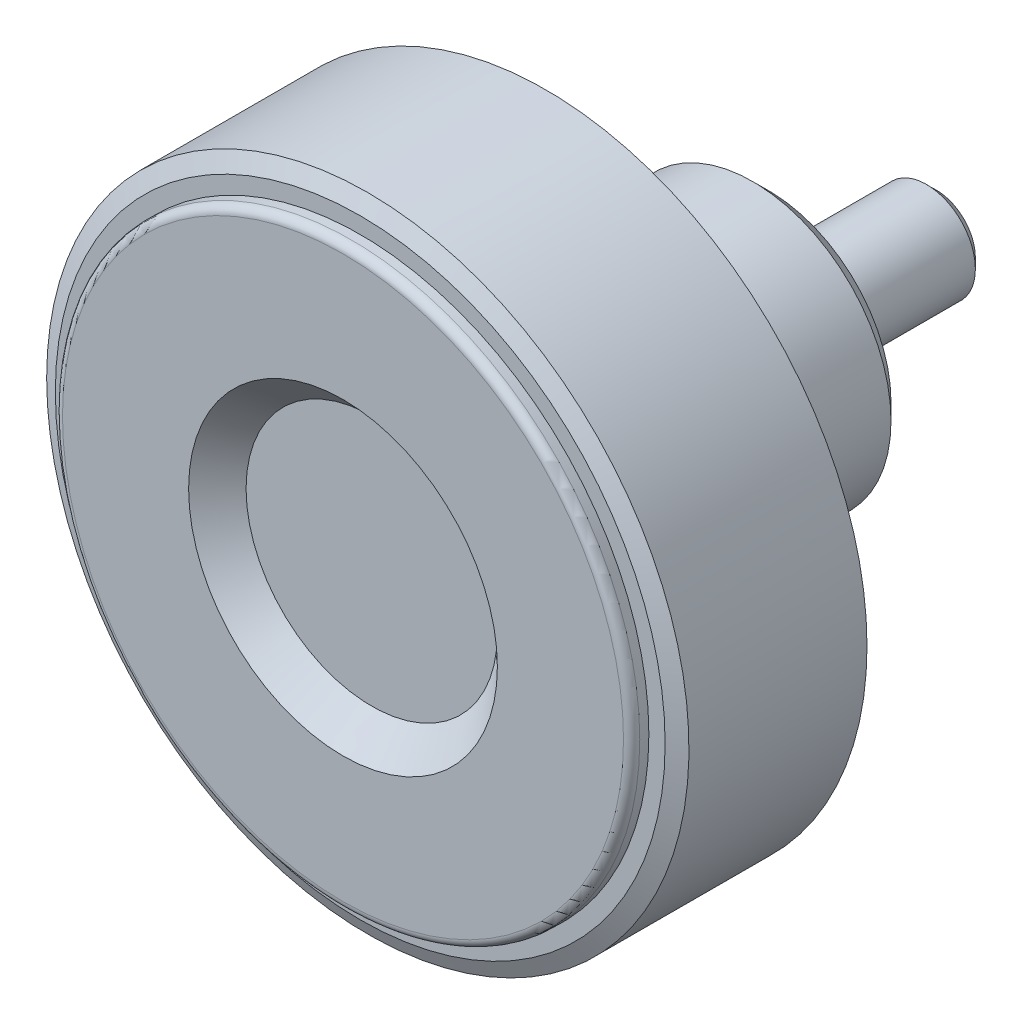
ISO-10303-21;
HEADER;
FILE_DESCRIPTION(('STEP AP214'),'2;1');
FILE_NAME('part.step','',(''),(''),'','','');
FILE_SCHEMA(('AUTOMOTIVE_DESIGN { 1 0 10303 214 1 1 1 1 }'));
ENDSEC;
DATA;
#1=APPLICATION_CONTEXT('core data for automotive mechanical design processes');
#2=APPLICATION_PROTOCOL_DEFINITION('international standard','automotive_design',2000,#1);
#3=PRODUCT_CONTEXT('',#1,'mechanical');
#4=PRODUCT('Part','Part','',(#3));
#5=PRODUCT_RELATED_PRODUCT_CATEGORY('part','',(#4));
#6=PRODUCT_DEFINITION_FORMATION('','',#4);
#7=PRODUCT_DEFINITION_CONTEXT('part definition',#1,'design');
#8=PRODUCT_DEFINITION('design','',#6,#7);
#9=PRODUCT_DEFINITION_SHAPE('','',#8);
#10=(LENGTH_UNIT() NAMED_UNIT(*) SI_UNIT(.MILLI.,.METRE.));
#11=(NAMED_UNIT(*) PLANE_ANGLE_UNIT() SI_UNIT($,.RADIAN.));
#12=(NAMED_UNIT(*) SI_UNIT($,.STERADIAN.) SOLID_ANGLE_UNIT());
#13=UNCERTAINTY_MEASURE_WITH_UNIT(LENGTH_MEASURE(1.E-05),#10,'distance_accuracy_value','');
#14=(GEOMETRIC_REPRESENTATION_CONTEXT(3) GLOBAL_UNCERTAINTY_ASSIGNED_CONTEXT((#13)) GLOBAL_UNIT_ASSIGNED_CONTEXT((#10,
#11,#12)) REPRESENTATION_CONTEXT('',''));
#15=CARTESIAN_POINT('',(0.,0.,0.));
#16=DIRECTION('',(0.,0.,1.));
#17=DIRECTION('',(1.,0.,0.));
#18=AXIS2_PLACEMENT_3D('',#15,#16,#17);
#19=CARTESIAN_POINT('',(0.,1.19325,-10.));
#20=DIRECTION('',(0.,0.,-1.));
#21=DIRECTION('',(-1.,0.,0.));
#22=AXIS2_PLACEMENT_3D('',#19,#20,#21);
#23=PLANE('',#22);
#24=CARTESIAN_POINT('',(0.,0.,-9.99999999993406));
#25=DIRECTION('',(0.,0.,1.));
#26=DIRECTION('',(1.,0.,0.));
#27=AXIS2_PLACEMENT_3D('',#24,#25,#26);
#28=CIRCLE('',#27,2.38650000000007);
#29=CARTESIAN_POINT('',(2.38650000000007,0.,-9.99999999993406));
#30=VERTEX_POINT('',#29);
#31=EDGE_CURVE('E179',#30,#30,#28,.T.);
#32=ORIENTED_EDGE('',*,*,#31,.F.);
#33=EDGE_LOOP('',(#32));
#34=FACE_BOUND('',#33,.T.);
#35=ADVANCED_FACE('F14',(#34),#23,.T.);
#36=CARTESIAN_POINT('',(0.,0.,-9.38649999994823));
#37=DIRECTION('',(0.,0.,1.));
#38=DIRECTION('',(1.,0.,0.));
#39=AXIS2_PLACEMENT_3D('',#36,#37,#38);
#40=CONICAL_SURFACE('',#39,2.99999999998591,0.785398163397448);
#41=ORIENTED_EDGE('',*,*,#31,.T.);
#42=EDGE_LOOP('',(#41));
#43=FACE_BOUND('',#42,.T.);
#44=CARTESIAN_POINT('',(0.,0.,-9.3865));
#45=DIRECTION('',(0.,0.,1.));
#46=DIRECTION('',(1.,0.,0.));
#47=AXIS2_PLACEMENT_3D('',#44,#45,#46);
#48=CIRCLE('',#47,3.);
#49=CARTESIAN_POINT('',(3.,0.,-9.3865));
#50=VERTEX_POINT('',#49);
#51=EDGE_CURVE('E176',#50,#50,#48,.T.);
#52=ORIENTED_EDGE('',*,*,#51,.F.);
#53=EDGE_LOOP('',(#52));
#54=FACE_BOUND('',#53,.T.);
#55=ADVANCED_FACE('F510',(#43,#54),#40,.T.);
#56=CARTESIAN_POINT('',(0.,0.,-4.19325));
#57=DIRECTION('',(0.,0.,1.));
#58=DIRECTION('',(1.,0.,0.));
#59=AXIS2_PLACEMENT_3D('',#56,#57,#58);
#60=CYLINDRICAL_SURFACE('',#59,3.);
#61=ORIENTED_EDGE('',*,*,#51,.T.);
#62=EDGE_LOOP('',(#61));
#63=FACE_BOUND('',#62,.T.);
#64=CARTESIAN_POINT('',(0.,0.,0.));
#65=DIRECTION('',(0.,0.,1.));
#66=DIRECTION('',(1.,0.,0.));
#67=AXIS2_PLACEMENT_3D('',#64,#65,#66);
#68=CIRCLE('',#67,3.);
#69=CARTESIAN_POINT('',(3.,0.,0.));
#70=VERTEX_POINT('',#69);
#71=EDGE_CURVE('E178',#70,#70,#68,.T.);
#72=ORIENTED_EDGE('',*,*,#71,.F.);
#73=EDGE_LOOP('',(#72));
#74=FACE_BOUND('',#73,.T.);
#75=ADVANCED_FACE('F501',(#63,#74),#60,.T.);
#76=CARTESIAN_POINT('',(0.,2.,0.));
#77=DIRECTION('',(0.,0.,-1.));
#78=DIRECTION('',(-1.,0.,0.));
#79=AXIS2_PLACEMENT_3D('',#76,#77,#78);
#80=PLANE('',#79);
#81=CARTESIAN_POINT('',(0.,0.,0.));
#82=DIRECTION('',(0.,0.,1.));
#83=DIRECTION('',(1.,0.,0.));
#84=AXIS2_PLACEMENT_3D('',#81,#82,#83);
#85=CIRCLE('',#84,4.);
#86=CARTESIAN_POINT('',(4.,0.,0.));
#87=VERTEX_POINT('',#86);
#88=EDGE_CURVE('E211',#87,#87,#85,.T.);
#89=ORIENTED_EDGE('',*,*,#88,.F.);
#90=EDGE_LOOP('',(#89));
#91=FACE_BOUND('',#90,.T.);
#92=ORIENTED_EDGE('',*,*,#71,.T.);
#93=EDGE_LOOP('',(#92));
#94=FACE_BOUND('',#93,.T.);
#95=ADVANCED_FACE('F492',(#91,#94),#80,.T.);
#96=CARTESIAN_POINT('',(0.,0.,0.15));
#97=DIRECTION('',(0.,0.,1.));
#98=DIRECTION('',(1.,0.,0.));
#99=AXIS2_PLACEMENT_3D('',#96,#97,#98);
#100=CYLINDRICAL_SURFACE('',#99,4.);
#101=ORIENTED_EDGE('',*,*,#88,.T.);
#102=EDGE_LOOP('',(#101));
#103=FACE_BOUND('',#102,.T.);
#104=CARTESIAN_POINT('',(0.,0.,0.3));
#105=DIRECTION('',(0.,0.,1.));
#106=DIRECTION('',(1.,0.,0.));
#107=AXIS2_PLACEMENT_3D('',#104,#105,#106);
#108=CIRCLE('',#107,4.);
#109=CARTESIAN_POINT('',(4.,0.,0.3));
#110=VERTEX_POINT('',#109);
#111=EDGE_CURVE('E208',#110,#110,#108,.T.);
#112=ORIENTED_EDGE('',*,*,#111,.F.);
#113=EDGE_LOOP('',(#112));
#114=FACE_BOUND('',#113,.T.);
#115=ADVANCED_FACE('F483',(#103,#114),#100,.T.);
#116=CARTESIAN_POINT('',(0.,5.75,0.3));
#117=DIRECTION('',(0.,0.,-1.));
#118=DIRECTION('',(-1.,0.,0.));
#119=AXIS2_PLACEMENT_3D('',#116,#117,#118);
#120=PLANE('',#119);
#121=CARTESIAN_POINT('',(0.,0.,0.3));
#122=DIRECTION('',(0.,0.,1.));
#123=DIRECTION('',(1.,0.,0.));
#124=AXIS2_PLACEMENT_3D('',#121,#122,#123);
#125=CIRCLE('',#124,7.5);
#126=CARTESIAN_POINT('',(7.5,0.,0.3));
#127=VERTEX_POINT('',#126);
#128=EDGE_CURVE('E175',#127,#127,#125,.T.);
#129=ORIENTED_EDGE('',*,*,#128,.F.);
#130=EDGE_LOOP('',(#129));
#131=FACE_BOUND('',#130,.T.);
#132=ORIENTED_EDGE('',*,*,#111,.T.);
#133=EDGE_LOOP('',(#132));
#134=FACE_BOUND('',#133,.T.);
#135=ADVANCED_FACE('F474',(#131,#134),#120,.T.);
#136=CARTESIAN_POINT('',(0.,0.,1.3));
#137=DIRECTION('',(0.,0.,1.));
#138=DIRECTION('',(1.,0.,0.));
#139=AXIS2_PLACEMENT_3D('',#136,#137,#138);
#140=CONICAL_SURFACE('',#139,8.5,0.785398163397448);
#141=ORIENTED_EDGE('',*,*,#128,.T.);
#142=EDGE_LOOP('',(#141));
#143=FACE_BOUND('',#142,.T.);
#144=CARTESIAN_POINT('',(0.,0.,1.3));
#145=DIRECTION('',(0.,0.,1.));
#146=DIRECTION('',(1.,0.,0.));
#147=AXIS2_PLACEMENT_3D('',#144,#145,#146);
#148=CIRCLE('',#147,8.5);
#149=CARTESIAN_POINT('',(8.5,0.,1.3));
#150=VERTEX_POINT('',#149);
#151=EDGE_CURVE('E172',#150,#150,#148,.T.);
#152=ORIENTED_EDGE('',*,*,#151,.F.);
#153=EDGE_LOOP('',(#152));
#154=FACE_BOUND('',#153,.T.);
#155=ADVANCED_FACE('F466',(#143,#154),#140,.T.);
#156=CARTESIAN_POINT('',(0.,0.,11.1916666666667));
#157=DIRECTION('',(0.,0.,1.));
#158=DIRECTION('',(1.,0.,0.));
#159=AXIS2_PLACEMENT_3D('',#156,#157,#158);
#160=CYLINDRICAL_SURFACE('',#159,8.5);
#161=ORIENTED_EDGE('',*,*,#151,.T.);
#162=EDGE_LOOP('',(#161));
#163=FACE_BOUND('',#162,.T.);
#164=CARTESIAN_POINT('',(0.,0.,21.0833333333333));
#165=DIRECTION('',(0.,0.,-1.));
#166=DIRECTION('',(-1.,0.,0.));
#167=AXIS2_PLACEMENT_3D('',#164,#165,#166);
#168=CIRCLE('',#167,8.5);
#169=CARTESIAN_POINT('',(-8.5,0.,21.0833333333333));
#170=VERTEX_POINT('',#169);
#171=EDGE_CURVE('E75',#170,#170,#168,.T.);
#172=ORIENTED_EDGE('',*,*,#171,.T.);
#173=EDGE_LOOP('',(#172));
#174=FACE_BOUND('',#173,.T.);
#175=ADVANCED_FACE('F459',(#163,#174),#160,.T.);
#176=CARTESIAN_POINT('',(0.,0.,21.0833333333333));
#177=DIRECTION('',(0.,0.,-1.));
#178=DIRECTION('',(-1.,0.,0.));
#179=AXIS2_PLACEMENT_3D('',#176,#177,#178);
#180=TOROIDAL_SURFACE('',#179,9.5,1.);
#181=CARTESIAN_POINT('',(0.,0.,22.0833333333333));
#182=DIRECTION('',(0.,0.,-1.));
#183=DIRECTION('',(1.,0.,0.));
#184=AXIS2_PLACEMENT_3D('',#181,#182,#183);
#185=CIRCLE('',#184,9.5);
#186=CARTESIAN_POINT('',(-9.5,0.,22.0833333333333));
#187=VERTEX_POINT('',#186);
#188=CARTESIAN_POINT('',(9.5,0.,22.0833333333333));
#189=VERTEX_POINT('',#188);
#190=EDGE_CURVE('E68',#187,#189,#185,.F.);
#191=ORIENTED_EDGE('',*,*,#190,.F.);
#192=CARTESIAN_POINT('',(0.,0.,22.0833333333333));
#193=DIRECTION('',(0.,0.,-1.));
#194=DIRECTION('',(-1.,0.,0.));
#195=AXIS2_PLACEMENT_3D('',#192,#193,#194);
#196=CIRCLE('',#195,9.5);
#197=CARTESIAN_POINT('',(0.,9.5,22.0833333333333));
#198=VERTEX_POINT('',#197);
#199=EDGE_CURVE('E71',#198,#187,#196,.F.);
#200=ORIENTED_EDGE('',*,*,#199,.F.);
#201=CARTESIAN_POINT('',(0.,0.,22.0833333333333));
#202=DIRECTION('',(0.,0.,-1.));
#203=DIRECTION('',(0.,1.,0.));
#204=AXIS2_PLACEMENT_3D('',#201,#202,#203);
#205=CIRCLE('',#204,9.5);
#206=EDGE_CURVE('E63',#189,#198,#205,.F.);
#207=ORIENTED_EDGE('',*,*,#206,.F.);
#208=EDGE_LOOP('',(#191,#200,#207));
#209=FACE_BOUND('',#208,.T.);
#210=ORIENTED_EDGE('',*,*,#171,.F.);
#211=EDGE_LOOP('',(#210));
#212=FACE_BOUND('',#211,.T.);
#213=ADVANCED_FACE('F66',(#209,#212),#180,.F.);
#214=CARTESIAN_POINT('',(0.,11.8461538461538,22.0833333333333));
#215=DIRECTION('',(0.,0.,-1.));
#216=DIRECTION('',(-1.,0.,0.));
#217=AXIS2_PLACEMENT_3D('',#214,#215,#216);
#218=PLANE('',#217);
#219=CARTESIAN_POINT('',(0.,0.,22.0833333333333));
#220=DIRECTION('',(0.,0.,1.));
#221=DIRECTION('',(-1.,0.,0.));
#222=AXIS2_PLACEMENT_3D('',#219,#220,#221);
#223=CIRCLE('',#222,14.1923076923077);
#224=CARTESIAN_POINT('',(14.1923076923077,0.,22.0833333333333));
#225=VERTEX_POINT('',#224);
#226=CARTESIAN_POINT('',(-14.1923076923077,0.,22.0833333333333));
#227=VERTEX_POINT('',#226);
#228=EDGE_CURVE('E81',#225,#227,#223,.F.);
#229=ORIENTED_EDGE('',*,*,#228,.T.);
#230=CARTESIAN_POINT('',(0.,0.,22.0833333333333));
#231=DIRECTION('',(0.,0.,1.));
#232=DIRECTION('',(0.,1.,0.));
#233=AXIS2_PLACEMENT_3D('',#230,#231,#232);
#234=CIRCLE('',#233,14.1923076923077);
#235=CARTESIAN_POINT('',(0.,14.1923076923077,22.0833333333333));
#236=VERTEX_POINT('',#235);
#237=EDGE_CURVE('E130',#227,#236,#234,.F.);
#238=ORIENTED_EDGE('',*,*,#237,.T.);
#239=CARTESIAN_POINT('',(0.,0.,22.0833333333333));
#240=DIRECTION('',(0.,0.,1.));
#241=DIRECTION('',(1.,0.,0.));
#242=AXIS2_PLACEMENT_3D('',#239,#240,#241);
#243=CIRCLE('',#242,14.1923076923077);
#244=EDGE_CURVE('E143',#236,#225,#243,.F.);
#245=ORIENTED_EDGE('',*,*,#244,.T.);
#246=EDGE_LOOP('',(#229,#238,#245));
#247=FACE_BOUND('',#246,.T.);
#248=ORIENTED_EDGE('',*,*,#199,.T.);
#249=ORIENTED_EDGE('',*,*,#190,.T.);
#250=ORIENTED_EDGE('',*,*,#206,.T.);
#251=EDGE_LOOP('',(#248,#249,#250));
#252=FACE_BOUND('',#251,.T.);
#253=ADVANCED_FACE('F79',(#247,#252),#218,.T.);
#254=CARTESIAN_POINT('',(0.,0.,21.0833333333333));
#255=DIRECTION('',(0.,0.,-1.));
#256=DIRECTION('',(-1.,0.,0.));
#257=AXIS2_PLACEMENT_3D('',#254,#255,#256);
#258=TOROIDAL_SURFACE('',#257,14.1923076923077,1.);
#259=ORIENTED_EDGE('',*,*,#237,.F.);
#260=ORIENTED_EDGE('',*,*,#228,.F.);
#261=ORIENTED_EDGE('',*,*,#244,.F.);
#262=EDGE_LOOP('',(#259,#260,#261));
#263=FACE_BOUND('',#262,.T.);
#264=CARTESIAN_POINT('',(0.,0.,21.0833333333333));
#265=DIRECTION('',(0.,0.,1.));
#266=DIRECTION('',(1.,0.,0.));
#267=AXIS2_PLACEMENT_3D('',#264,#265,#266);
#268=CIRCLE('',#267,15.1923076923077);
#269=CARTESIAN_POINT('',(15.1923076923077,0.,21.0833333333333));
#270=VERTEX_POINT('',#269);
#271=EDGE_CURVE('E205',#270,#270,#268,.F.);
#272=ORIENTED_EDGE('',*,*,#271,.T.);
#273=EDGE_LOOP('',(#272));
#274=FACE_BOUND('',#273,.T.);
#275=ADVANCED_FACE('F100',(#263,#274),#258,.F.);
#276=CARTESIAN_POINT('',(0.,0.,16.7916666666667));
#277=DIRECTION('',(0.,0.,1.));
#278=DIRECTION('',(1.,0.,0.));
#279=AXIS2_PLACEMENT_3D('',#276,#277,#278);
#280=CYLINDRICAL_SURFACE('',#279,15.1923076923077);
#281=ORIENTED_EDGE('',*,*,#271,.F.);
#282=EDGE_LOOP('',(#281));
#283=FACE_BOUND('',#282,.T.);
#284=CARTESIAN_POINT('',(0.,0.,12.5));
#285=DIRECTION('',(0.,0.,1.));
#286=DIRECTION('',(1.,0.,0.));
#287=AXIS2_PLACEMENT_3D('',#284,#285,#286);
#288=CIRCLE('',#287,15.1923076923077);
#289=CARTESIAN_POINT('',(15.1923076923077,0.,12.5));
#290=VERTEX_POINT('',#289);
#291=EDGE_CURVE('E201',#290,#290,#288,.T.);
#292=ORIENTED_EDGE('',*,*,#291,.F.);
#293=EDGE_LOOP('',(#292));
#294=FACE_BOUND('',#293,.T.);
#295=ADVANCED_FACE('F329',(#283,#294),#280,.F.);
#296=CARTESIAN_POINT('',(0.,16.2211538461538,12.5));
#297=DIRECTION('',(0.,0.,-1.));
#298=DIRECTION('',(-1.,0.,0.));
#299=AXIS2_PLACEMENT_3D('',#296,#297,#298);
#300=PLANE('',#299);
#301=CARTESIAN_POINT('',(0.,0.,12.5));
#302=DIRECTION('',(0.,0.,1.));
#303=DIRECTION('',(-1.,0.,0.));
#304=AXIS2_PLACEMENT_3D('',#301,#302,#303);
#305=CIRCLE('',#304,17.25);
#306=CARTESIAN_POINT('',(-17.25,0.,12.5));
#307=VERTEX_POINT('',#306);
#308=CARTESIAN_POINT('',(17.25,0.,12.5));
#309=VERTEX_POINT('',#308);
#310=EDGE_CURVE('E264',#307,#309,#305,.T.);
#311=ORIENTED_EDGE('',*,*,#310,.F.);
#312=CARTESIAN_POINT('',(0.,0.,12.5));
#313=DIRECTION('',(0.,0.,1.));
#314=DIRECTION('',(0.,1.,0.));
#315=AXIS2_PLACEMENT_3D('',#312,#313,#314);
#316=CIRCLE('',#315,17.25);
#317=CARTESIAN_POINT('',(0.,17.25,12.5));
#318=VERTEX_POINT('',#317);
#319=EDGE_CURVE('E299',#318,#307,#316,.T.);
#320=ORIENTED_EDGE('',*,*,#319,.F.);
#321=CARTESIAN_POINT('',(0.,0.,12.5));
#322=DIRECTION('',(0.,0.,1.));
#323=DIRECTION('',(1.,0.,0.));
#324=AXIS2_PLACEMENT_3D('',#321,#322,#323);
#325=CIRCLE('',#324,17.25);
#326=EDGE_CURVE('E204',#309,#318,#325,.T.);
#327=ORIENTED_EDGE('',*,*,#326,.F.);
#328=EDGE_LOOP('',(#311,#320,#327));
#329=FACE_BOUND('',#328,.T.);
#330=ORIENTED_EDGE('',*,*,#291,.T.);
#331=EDGE_LOOP('',(#330));
#332=FACE_BOUND('',#331,.T.);
#333=ADVANCED_FACE('F275',(#329,#332),#300,.T.);
#334=CARTESIAN_POINT('',(0.,0.,13.));
#335=DIRECTION('',(0.,0.,-1.));
#336=DIRECTION('',(-1.,0.,0.));
#337=AXIS2_PLACEMENT_3D('',#334,#335,#336);
#338=TOROIDAL_SURFACE('',#337,17.25,0.5);
#339=ORIENTED_EDGE('',*,*,#319,.T.);
#340=ORIENTED_EDGE('',*,*,#310,.T.);
#341=ORIENTED_EDGE('',*,*,#326,.T.);
#342=EDGE_LOOP('',(#339,#340,#341));
#343=FACE_BOUND('',#342,.T.);
#344=CARTESIAN_POINT('',(0.,0.,13.));
#345=DIRECTION('',(0.,0.,1.));
#346=DIRECTION('',(1.,0.,0.));
#347=AXIS2_PLACEMENT_3D('',#344,#345,#346);
#348=CIRCLE('',#347,17.75);
#349=CARTESIAN_POINT('',(17.75,0.,13.));
#350=VERTEX_POINT('',#349);
#351=EDGE_CURVE('E200',#350,#350,#348,.T.);
#352=ORIENTED_EDGE('',*,*,#351,.F.);
#353=EDGE_LOOP('',(#352));
#354=FACE_BOUND('',#353,.T.);
#355=ADVANCED_FACE('F269',(#343,#354),#338,.T.);
#356=CARTESIAN_POINT('',(0.,0.,13.28));
#357=DIRECTION('',(0.,0.,1.));
#358=DIRECTION('',(1.,0.,0.));
#359=AXIS2_PLACEMENT_3D('',#356,#357,#358);
#360=CYLINDRICAL_SURFACE('',#359,17.75);
#361=ORIENTED_EDGE('',*,*,#351,.T.);
#362=EDGE_LOOP('',(#361));
#363=FACE_BOUND('',#362,.T.);
#364=CARTESIAN_POINT('',(0.,0.,13.56));
#365=DIRECTION('',(0.,0.,1.));
#366=DIRECTION('',(1.,0.,0.));
#367=AXIS2_PLACEMENT_3D('',#364,#365,#366);
#368=CIRCLE('',#367,17.75);
#369=CARTESIAN_POINT('',(17.75,0.,13.56));
#370=VERTEX_POINT('',#369);
#371=EDGE_CURVE('E197',#370,#370,#368,.T.);
#372=ORIENTED_EDGE('',*,*,#371,.F.);
#373=EDGE_LOOP('',(#372));
#374=FACE_BOUND('',#373,.T.);
#375=ADVANCED_FACE('F274',(#363,#374),#360,.T.);
#376=CARTESIAN_POINT('',(0.,18.25,13.56));
#377=DIRECTION('',(0.,0.,-1.));
#378=DIRECTION('',(-1.,0.,0.));
#379=AXIS2_PLACEMENT_3D('',#376,#377,#378);
#380=PLANE('',#379);
#381=CARTESIAN_POINT('',(0.,0.,13.56));
#382=DIRECTION('',(0.,0.,1.));
#383=DIRECTION('',(1.,0.,0.));
#384=AXIS2_PLACEMENT_3D('',#381,#382,#383);
#385=CIRCLE('',#384,18.75);
#386=CARTESIAN_POINT('',(18.75,0.,13.56));
#387=VERTEX_POINT('',#386);
#388=EDGE_CURVE('E193',#387,#387,#385,.T.);
#389=ORIENTED_EDGE('',*,*,#388,.F.);
#390=EDGE_LOOP('',(#389));
#391=FACE_BOUND('',#390,.T.);
#392=ORIENTED_EDGE('',*,*,#371,.T.);
#393=EDGE_LOOP('',(#392));
#394=FACE_BOUND('',#393,.T.);
#395=ADVANCED_FACE('F341',(#391,#394),#380,.T.);
#396=CARTESIAN_POINT('',(0.,0.,14.026307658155));
#397=DIRECTION('',(0.,0.,1.));
#398=DIRECTION('',(1.,0.,0.));
#399=AXIS2_PLACEMENT_3D('',#396,#397,#398);
#400=CONICAL_SURFACE('',#399,19.75,1.13446401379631);
#401=CARTESIAN_POINT('',(-1.50102152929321E-13,-1.52766688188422E-12,14.026307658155));
#402=DIRECTION('',(0.,0.,-1.));
#403=DIRECTION('',(-1.,0.,0.));
#404=AXIS2_PLACEMENT_3D('',#401,#402,#403);
#405=CIRCLE('',#404,19.7500000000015);
#406=CARTESIAN_POINT('',(-19.7500000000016,-1.52766688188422E-12,14.026307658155));
#407=VERTEX_POINT('',#406);
#408=EDGE_CURVE('E196',#407,#407,#405,.F.);
#409=ORIENTED_EDGE('',*,*,#408,.F.);
#410=EDGE_LOOP('',(#409));
#411=FACE_BOUND('',#410,.T.);
#412=ORIENTED_EDGE('',*,*,#388,.T.);
#413=EDGE_LOOP('',(#412));
#414=FACE_BOUND('',#413,.T.);
#415=ADVANCED_FACE('F339',(#411,#414),#400,.T.);
#416=CARTESIAN_POINT('',(0.,3.86363636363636,24.7333333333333));
#417=DIRECTION('',(0.,0.,1.));
#418=DIRECTION('',(1.,0.,0.));
#419=AXIS2_PLACEMENT_3D('',#416,#417,#418);
#420=PLANE('',#419);
#421=CARTESIAN_POINT('',(0.,0.,24.7333333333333));
#422=DIRECTION('',(0.,0.,1.));
#423=DIRECTION('',(1.,0.,0.));
#424=AXIS2_PLACEMENT_3D('',#421,#422,#423);
#425=CIRCLE('',#424,7.7272727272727);
#426=CARTESIAN_POINT('',(7.7272727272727,0.,24.7333333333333));
#427=VERTEX_POINT('',#426);
#428=EDGE_CURVE('E181',#427,#427,#425,.T.);
#429=ORIENTED_EDGE('',*,*,#428,.T.);
#430=EDGE_LOOP('',(#429));
#431=FACE_BOUND('',#430,.T.);
#432=ADVANCED_FACE('F242',(#431),#420,.T.);
#433=CARTESIAN_POINT('',(0.,0.,26.5));
#434=DIRECTION('',(0.,0.,1.));
#435=DIRECTION('',(1.,0.,0.));
#436=AXIS2_PLACEMENT_3D('',#433,#434,#435);
#437=CONICAL_SURFACE('',#436,9.49393939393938,0.785398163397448);
#438=CARTESIAN_POINT('',(0.,0.,26.5));
#439=DIRECTION('',(0.,0.,1.));
#440=DIRECTION('',(1.,0.,0.));
#441=AXIS2_PLACEMENT_3D('',#438,#439,#440);
#442=CIRCLE('',#441,9.49393939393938);
#443=CARTESIAN_POINT('',(9.49393939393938,0.,26.5));
#444=VERTEX_POINT('',#443);
#445=EDGE_CURVE('E9',#444,#444,#442,.F.);
#446=ORIENTED_EDGE('',*,*,#445,.F.);
#447=EDGE_LOOP('',(#446));
#448=FACE_BOUND('',#447,.T.);
#449=ORIENTED_EDGE('',*,*,#428,.F.);
#450=EDGE_LOOP('',(#449));
#451=FACE_BOUND('',#450,.T.);
#452=ADVANCED_FACE('F240',(#448,#451),#437,.F.);
#453=CARTESIAN_POINT('',(0.,13.3719696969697,26.5));
#454=DIRECTION('',(0.,0.,1.));
#455=DIRECTION('',(1.,0.,0.));
#456=AXIS2_PLACEMENT_3D('',#453,#454,#455);
#457=PLANE('',#456);
#458=ORIENTED_EDGE('',*,*,#445,.T.);
#459=EDGE_LOOP('',(#458));
#460=FACE_BOUND('',#459,.T.);
#461=CARTESIAN_POINT('',(0.,0.,26.5));
#462=DIRECTION('',(0.,0.,-1.));
#463=DIRECTION('',(-1.,0.,0.));
#464=AXIS2_PLACEMENT_3D('',#461,#462,#463);
#465=CIRCLE('',#464,17.25);
#466=CARTESIAN_POINT('',(0.,17.25,26.5));
#467=VERTEX_POINT('',#466);
#468=CARTESIAN_POINT('',(-17.25,0.,26.5));
#469=VERTEX_POINT('',#468);
#470=EDGE_CURVE('E219',#467,#469,#465,.F.);
#471=ORIENTED_EDGE('',*,*,#470,.T.);
#472=CARTESIAN_POINT('',(0.,0.,26.5));
#473=DIRECTION('',(0.,0.,-1.));
#474=DIRECTION('',(1.,0.,0.));
#475=AXIS2_PLACEMENT_3D('',#472,#473,#474);
#476=CIRCLE('',#475,17.25);
#477=CARTESIAN_POINT('',(17.25,0.,26.5));
#478=VERTEX_POINT('',#477);
#479=EDGE_CURVE('E23',#469,#478,#476,.F.);
#480=ORIENTED_EDGE('',*,*,#479,.T.);
#481=CARTESIAN_POINT('',(0.,0.,26.5));
#482=DIRECTION('',(0.,0.,-1.));
#483=DIRECTION('',(0.,1.,0.));
#484=AXIS2_PLACEMENT_3D('',#481,#482,#483);
#485=CIRCLE('',#484,17.25);
#486=EDGE_CURVE('E184',#478,#467,#485,.F.);
#487=ORIENTED_EDGE('',*,*,#486,.T.);
#488=EDGE_LOOP('',(#471,#480,#487));
#489=FACE_BOUND('',#488,.T.);
#490=ADVANCED_FACE('F238',(#460,#489),#457,.T.);
#491=CARTESIAN_POINT('',(0.,0.,26.));
#492=DIRECTION('',(0.,0.,-1.));
#493=DIRECTION('',(-1.,0.,0.));
#494=AXIS2_PLACEMENT_3D('',#491,#492,#493);
#495=TOROIDAL_SURFACE('',#494,17.25,0.5);
#496=CARTESIAN_POINT('',(0.,0.,26.));
#497=DIRECTION('',(0.,0.,-1.));
#498=DIRECTION('',(-1.,0.,0.));
#499=AXIS2_PLACEMENT_3D('',#496,#497,#498);
#500=CIRCLE('',#499,17.75);
#501=CARTESIAN_POINT('',(-17.75,0.,26.));
#502=VERTEX_POINT('',#501);
#503=EDGE_CURVE('E185',#502,#502,#500,.F.);
#504=ORIENTED_EDGE('',*,*,#503,.T.);
#505=EDGE_LOOP('',(#504));
#506=FACE_BOUND('',#505,.T.);
#507=ORIENTED_EDGE('',*,*,#479,.F.);
#508=ORIENTED_EDGE('',*,*,#470,.F.);
#509=ORIENTED_EDGE('',*,*,#486,.F.);
#510=EDGE_LOOP('',(#507,#508,#509));
#511=FACE_BOUND('',#510,.T.);
#512=ADVANCED_FACE('F226',(#506,#511),#495,.T.);
#513=CARTESIAN_POINT('',(0.,0.,25.72));
#514=DIRECTION('',(0.,0.,1.));
#515=DIRECTION('',(1.,0.,0.));
#516=AXIS2_PLACEMENT_3D('',#513,#514,#515);
#517=CYLINDRICAL_SURFACE('',#516,17.75);
#518=ORIENTED_EDGE('',*,*,#503,.F.);
#519=EDGE_LOOP('',(#518));
#520=FACE_BOUND('',#519,.T.);
#521=CARTESIAN_POINT('',(0.,0.,25.44));
#522=DIRECTION('',(0.,0.,1.));
#523=DIRECTION('',(1.,0.,0.));
#524=AXIS2_PLACEMENT_3D('',#521,#522,#523);
#525=CIRCLE('',#524,17.75);
#526=CARTESIAN_POINT('',(17.75,0.,25.44));
#527=VERTEX_POINT('',#526);
#528=EDGE_CURVE('E186',#527,#527,#525,.T.);
#529=ORIENTED_EDGE('',*,*,#528,.T.);
#530=EDGE_LOOP('',(#529));
#531=FACE_BOUND('',#530,.T.);
#532=ADVANCED_FACE('F237',(#520,#531),#517,.T.);
#533=CARTESIAN_POINT('',(0.,0.,24.973692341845));
#534=DIRECTION('',(0.,0.,-1.));
#535=DIRECTION('',(-1.,0.,0.));
#536=AXIS2_PLACEMENT_3D('',#533,#534,#535);
#537=CONICAL_SURFACE('',#536,19.75,1.13446401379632);
#538=CARTESIAN_POINT('',(0.,0.,25.44));
#539=DIRECTION('',(0.,0.,-1.));
#540=DIRECTION('',(-1.,0.,0.));
#541=AXIS2_PLACEMENT_3D('',#538,#539,#540);
#542=CIRCLE('',#541,18.75);
#543=CARTESIAN_POINT('',(-18.75,0.,25.44));
#544=VERTEX_POINT('',#543);
#545=EDGE_CURVE('E189',#544,#544,#542,.F.);
#546=ORIENTED_EDGE('',*,*,#545,.F.);
#547=EDGE_LOOP('',(#546));
#548=FACE_BOUND('',#547,.T.);
#549=CARTESIAN_POINT('',(0.,0.,24.973692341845));
#550=DIRECTION('',(0.,0.,-1.));
#551=DIRECTION('',(0.,1.,0.));
#552=AXIS2_PLACEMENT_3D('',#549,#550,#551);
#553=CIRCLE('',#552,19.75);
#554=CARTESIAN_POINT('',(0.,19.75,24.973692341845));
#555=VERTEX_POINT('',#554);
#556=EDGE_CURVE('E192',#555,#555,#553,.F.);
#557=ORIENTED_EDGE('',*,*,#556,.T.);
#558=EDGE_LOOP('',(#557));
#559=FACE_BOUND('',#558,.T.);
#560=ADVANCED_FACE('F358',(#548,#559),#537,.T.);
#561=CARTESIAN_POINT('',(0.,18.25,25.44));
#562=DIRECTION('',(0.,0.,1.));
#563=DIRECTION('',(1.,0.,0.));
#564=AXIS2_PLACEMENT_3D('',#561,#562,#563);
#565=PLANE('',#564);
#566=ORIENTED_EDGE('',*,*,#528,.F.);
#567=EDGE_LOOP('',(#566));
#568=FACE_BOUND('',#567,.T.);
#569=ORIENTED_EDGE('',*,*,#545,.T.);
#570=EDGE_LOOP('',(#569));
#571=FACE_BOUND('',#570,.T.);
#572=ADVANCED_FACE('F356',(#568,#571),#565,.T.);
#573=CARTESIAN_POINT('',(-1.50102152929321E-13,-1.52766688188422E-12,0.));
#574=DIRECTION('',(0.,0.,-1.));
#575=DIRECTION('',(-1.,0.,0.));
#576=AXIS2_PLACEMENT_3D('',#573,#574,#575);
#577=CYLINDRICAL_SURFACE('',#576,19.7500000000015);
#578=ORIENTED_EDGE('',*,*,#408,.T.);
#579=EDGE_LOOP('',(#578));
#580=FACE_BOUND('',#579,.T.);
#581=ORIENTED_EDGE('',*,*,#556,.F.);
#582=EDGE_LOOP('',(#581));
#583=FACE_BOUND('',#582,.T.);
#584=ADVANCED_FACE('F353',(#580,#583),#577,.T.);
#585=CLOSED_SHELL('',(#35,#55,#75,#95,#115,#135,#155,#175,#213,#253,#275,#295,#333,#355,#375,
#395,#415,#432,#452,#490,#512,#532,#560,#572,#584));
#586=MANIFOLD_SOLID_BREP('B1',#585);
#587=ADVANCED_BREP_SHAPE_REPRESENTATION('',(#18,#586),#14);
#588=SHAPE_DEFINITION_REPRESENTATION(#9,#587);
ENDSEC;
END-ISO-10303-21;
